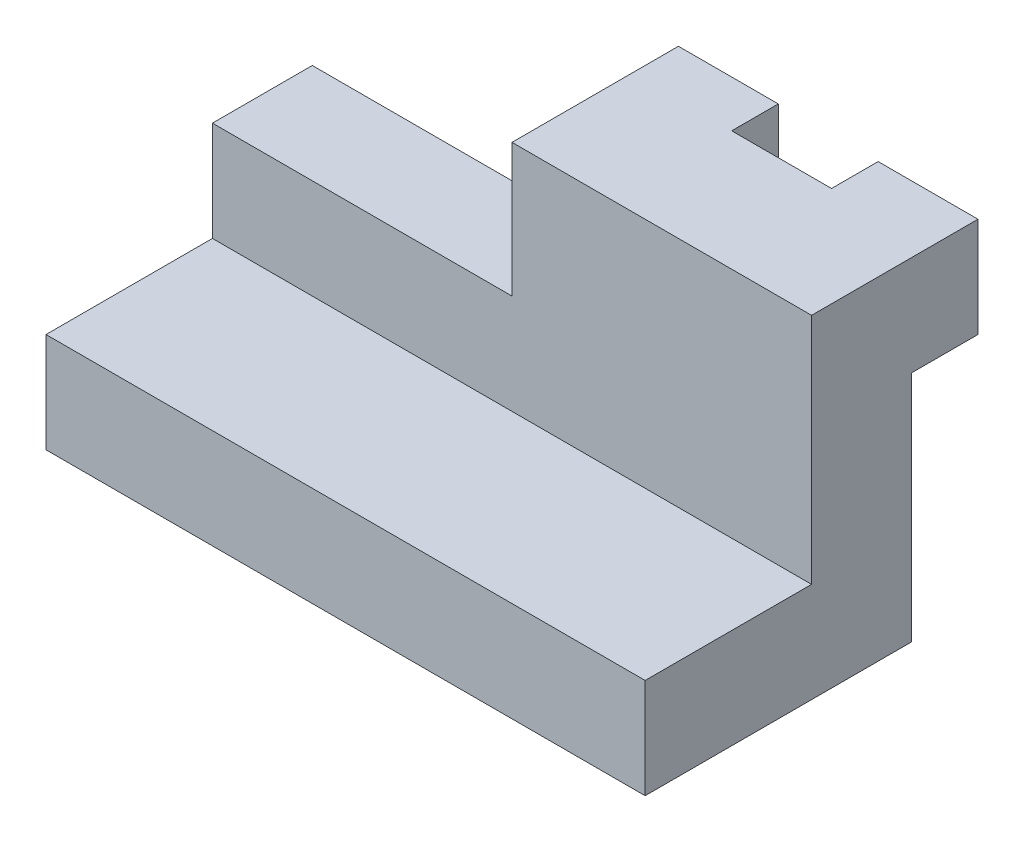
ISO-10303-21;
HEADER;
FILE_DESCRIPTION(('STEP AP214'),'2;1');
FILE_NAME('part.step','',(''),(''),'','','');
FILE_SCHEMA(('AUTOMOTIVE_DESIGN { 1 0 10303 214 1 1 1 1 }'));
ENDSEC;
DATA;
#1=APPLICATION_CONTEXT('core data for automotive mechanical design processes');
#2=APPLICATION_PROTOCOL_DEFINITION('international standard','automotive_design',2000,#1);
#3=PRODUCT_CONTEXT('',#1,'mechanical');
#4=PRODUCT('Part','Part','',(#3));
#5=PRODUCT_RELATED_PRODUCT_CATEGORY('part','',(#4));
#6=PRODUCT_DEFINITION_FORMATION('','',#4);
#7=PRODUCT_DEFINITION_CONTEXT('part definition',#1,'design');
#8=PRODUCT_DEFINITION('design','',#6,#7);
#9=PRODUCT_DEFINITION_SHAPE('','',#8);
#10=(LENGTH_UNIT() NAMED_UNIT(*) SI_UNIT(.MILLI.,.METRE.));
#11=(NAMED_UNIT(*) PLANE_ANGLE_UNIT() SI_UNIT($,.RADIAN.));
#12=(NAMED_UNIT(*) SI_UNIT($,.STERADIAN.) SOLID_ANGLE_UNIT());
#13=UNCERTAINTY_MEASURE_WITH_UNIT(LENGTH_MEASURE(1.E-05),#10,'distance_accuracy_value','');
#14=(GEOMETRIC_REPRESENTATION_CONTEXT(3) GLOBAL_UNCERTAINTY_ASSIGNED_CONTEXT((#13)) GLOBAL_UNIT_ASSIGNED_CONTEXT((#10,
#11,#12)) REPRESENTATION_CONTEXT('',''));
#15=CARTESIAN_POINT('',(0.,0.,0.));
#16=DIRECTION('',(0.,0.,1.));
#17=DIRECTION('',(1.,0.,0.));
#18=AXIS2_PLACEMENT_3D('',#15,#16,#17);
#19=CARTESIAN_POINT('',(0.,15.,-40.));
#20=DIRECTION('',(0.,-1.,0.));
#21=DIRECTION('',(0.,0.,-1.));
#22=AXIS2_PLACEMENT_3D('',#19,#20,#21);
#23=PLANE('',#22);
#24=DIRECTION('',(1.,0.,0.));
#25=VECTOR('',#24,1.);
#26=CARTESIAN_POINT('',(0.,15.,-25.));
#27=LINE('',#26,#25);
#28=CARTESIAN_POINT('',(0.,15.,-25.));
#29=VERTEX_POINT('',#28);
#30=CARTESIAN_POINT('',(90.,15.,-25.));
#31=VERTEX_POINT('',#30);
#32=EDGE_CURVE('E56',#29,#31,#27,.T.);
#33=ORIENTED_EDGE('',*,*,#32,.F.);
#34=DIRECTION('',(0.,0.,1.));
#35=VECTOR('',#34,1.);
#36=CARTESIAN_POINT('',(0.,15.,0.));
#37=LINE('',#36,#35);
#38=CARTESIAN_POINT('',(0.,15.,0.));
#39=VERTEX_POINT('',#38);
#40=EDGE_CURVE('E218',#29,#39,#37,.T.);
#41=ORIENTED_EDGE('',*,*,#40,.T.);
#42=DIRECTION('',(1.,0.,0.));
#43=VECTOR('',#42,1.);
#44=CARTESIAN_POINT('',(0.,15.,0.));
#45=LINE('',#44,#43);
#46=CARTESIAN_POINT('',(90.,15.,0.));
#47=VERTEX_POINT('',#46);
#48=EDGE_CURVE('E212',#39,#47,#45,.T.);
#49=ORIENTED_EDGE('',*,*,#48,.T.);
#50=DIRECTION('',(0.,0.,-1.));
#51=VECTOR('',#50,1.);
#52=CARTESIAN_POINT('',(90.,15.,0.));
#53=LINE('',#52,#51);
#54=EDGE_CURVE('E205',#47,#31,#53,.T.);
#55=ORIENTED_EDGE('',*,*,#54,.T.);
#56=EDGE_LOOP('',(#33,#41,#49,#55));
#57=FACE_BOUND('',#56,.T.);
#58=ADVANCED_FACE('F31',(#57),#23,.F.);
#59=CARTESIAN_POINT('',(0.,15.,0.));
#60=DIRECTION('',(1.,0.,0.));
#61=DIRECTION('',(0.,0.,-1.));
#62=AXIS2_PLACEMENT_3D('',#59,#60,#61);
#63=PLANE('',#62);
#64=DIRECTION('',(0.,0.,1.));
#65=VECTOR('',#64,1.);
#66=CARTESIAN_POINT('',(0.,0.,0.));
#67=LINE('',#66,#65);
#68=CARTESIAN_POINT('',(0.,0.,-40.));
#69=VERTEX_POINT('',#68);
#70=CARTESIAN_POINT('',(0.,0.,0.));
#71=VERTEX_POINT('',#70);
#72=EDGE_CURVE('E229',#69,#71,#67,.T.);
#73=ORIENTED_EDGE('',*,*,#72,.T.);
#74=DIRECTION('',(0.,-1.,0.));
#75=VECTOR('',#74,1.);
#76=CARTESIAN_POINT('',(0.,15.,0.));
#77=LINE('',#76,#75);
#78=EDGE_CURVE('E11',#39,#71,#77,.T.);
#79=ORIENTED_EDGE('',*,*,#78,.F.);
#80=ORIENTED_EDGE('',*,*,#40,.F.);
#81=DIRECTION('',(0.,-1.,0.));
#82=VECTOR('',#81,1.);
#83=CARTESIAN_POINT('',(0.,30.,-25.));
#84=LINE('',#83,#82);
#85=CARTESIAN_POINT('',(0.,30.,-25.));
#86=VERTEX_POINT('',#85);
#87=EDGE_CURVE('E143',#86,#29,#84,.T.);
#88=ORIENTED_EDGE('',*,*,#87,.F.);
#89=DIRECTION('',(0.,0.,1.));
#90=VECTOR('',#89,1.);
#91=CARTESIAN_POINT('',(0.,30.,-40.));
#92=LINE('',#91,#90);
#93=CARTESIAN_POINT('',(0.,30.,-40.));
#94=VERTEX_POINT('',#93);
#95=EDGE_CURVE('E452',#94,#86,#92,.T.);
#96=ORIENTED_EDGE('',*,*,#95,.F.);
#97=DIRECTION('',(0.,-1.,0.));
#98=VECTOR('',#97,1.);
#99=CARTESIAN_POINT('',(0.,15.,-40.));
#100=LINE('',#99,#98);
#101=EDGE_CURVE('E198',#94,#69,#100,.T.);
#102=ORIENTED_EDGE('',*,*,#101,.T.);
#103=EDGE_LOOP('',(#73,#79,#80,#88,#96,#102));
#104=FACE_BOUND('',#103,.T.);
#105=ADVANCED_FACE('F33',(#104),#63,.F.);
#106=CARTESIAN_POINT('',(0.,15.,0.));
#107=DIRECTION('',(0.,0.,-1.));
#108=DIRECTION('',(-1.,0.,0.));
#109=AXIS2_PLACEMENT_3D('',#106,#107,#108);
#110=PLANE('',#109);
#111=DIRECTION('',(1.,0.,0.));
#112=VECTOR('',#111,1.);
#113=CARTESIAN_POINT('',(0.,0.,0.));
#114=LINE('',#113,#112);
#115=CARTESIAN_POINT('',(90.,0.,0.));
#116=VERTEX_POINT('',#115);
#117=EDGE_CURVE('E231',#71,#116,#114,.T.);
#118=ORIENTED_EDGE('',*,*,#117,.T.);
#119=DIRECTION('',(0.,-1.,0.));
#120=VECTOR('',#119,1.);
#121=CARTESIAN_POINT('',(90.,15.,0.));
#122=LINE('',#121,#120);
#123=EDGE_CURVE('E40',#47,#116,#122,.T.);
#124=ORIENTED_EDGE('',*,*,#123,.F.);
#125=ORIENTED_EDGE('',*,*,#48,.F.);
#126=ORIENTED_EDGE('',*,*,#78,.T.);
#127=EDGE_LOOP('',(#118,#124,#125,#126));
#128=FACE_BOUND('',#127,.T.);
#129=ADVANCED_FACE('F241',(#128),#110,.F.);
#130=CARTESIAN_POINT('',(90.,15.,0.));
#131=DIRECTION('',(-1.,0.,0.));
#132=DIRECTION('',(0.,0.,1.));
#133=AXIS2_PLACEMENT_3D('',#130,#131,#132);
#134=PLANE('',#133);
#135=DIRECTION('',(0.,0.,-1.));
#136=VECTOR('',#135,1.);
#137=CARTESIAN_POINT('',(90.,0.,0.));
#138=LINE('',#137,#136);
#139=CARTESIAN_POINT('',(90.,0.,-40.));
#140=VERTEX_POINT('',#139);
#141=EDGE_CURVE('E232',#116,#140,#138,.T.);
#142=ORIENTED_EDGE('',*,*,#141,.T.);
#143=DIRECTION('',(0.,-1.,0.));
#144=VECTOR('',#143,1.);
#145=CARTESIAN_POINT('',(90.,15.,-40.));
#146=LINE('',#145,#144);
#147=CARTESIAN_POINT('',(90.,35.,-40.));
#148=VERTEX_POINT('',#147);
#149=EDGE_CURVE('E196',#148,#140,#146,.T.);
#150=ORIENTED_EDGE('',*,*,#149,.F.);
#151=DIRECTION('',(0.,0.,-1.));
#152=VECTOR('',#151,1.);
#153=CARTESIAN_POINT('',(90.,35.,-50.));
#154=LINE('',#153,#152);
#155=CARTESIAN_POINT('',(90.,35.,-50.));
#156=VERTEX_POINT('',#155);
#157=EDGE_CURVE('E181',#148,#156,#154,.T.);
#158=ORIENTED_EDGE('',*,*,#157,.T.);
#159=DIRECTION('',(0.,-1.,0.));
#160=VECTOR('',#159,1.);
#161=CARTESIAN_POINT('',(90.,50.,-50.));
#162=LINE('',#161,#160);
#163=CARTESIAN_POINT('',(90.,50.,-50.));
#164=VERTEX_POINT('',#163);
#165=EDGE_CURVE('E150',#164,#156,#162,.T.);
#166=ORIENTED_EDGE('',*,*,#165,.F.);
#167=DIRECTION('',(0.,0.,-1.));
#168=VECTOR('',#167,1.);
#169=CARTESIAN_POINT('',(90.,50.,-50.));
#170=LINE('',#169,#168);
#171=CARTESIAN_POINT('',(90.,50.,-25.));
#172=VERTEX_POINT('',#171);
#173=EDGE_CURVE('E147',#172,#164,#170,.T.);
#174=ORIENTED_EDGE('',*,*,#173,.F.);
#175=DIRECTION('',(0.,-1.,0.));
#176=VECTOR('',#175,1.);
#177=CARTESIAN_POINT('',(90.,30.,-25.));
#178=LINE('',#177,#176);
#179=EDGE_CURVE('E134',#172,#31,#178,.T.);
#180=ORIENTED_EDGE('',*,*,#179,.T.);
#181=ORIENTED_EDGE('',*,*,#54,.F.);
#182=ORIENTED_EDGE('',*,*,#123,.T.);
#183=EDGE_LOOP('',(#142,#150,#158,#166,#174,#180,#181,#182));
#184=FACE_BOUND('',#183,.T.);
#185=ADVANCED_FACE('F148',(#184),#134,.F.);
#186=CARTESIAN_POINT('',(0.,15.,-40.));
#187=DIRECTION('',(0.,0.,1.));
#188=DIRECTION('',(1.,0.,0.));
#189=AXIS2_PLACEMENT_3D('',#186,#187,#188);
#190=PLANE('',#189);
#191=DIRECTION('',(-1.,0.,0.));
#192=VECTOR('',#191,1.);
#193=CARTESIAN_POINT('',(0.,0.,-40.));
#194=LINE('',#193,#192);
#195=EDGE_CURVE('E215',#140,#69,#194,.T.);
#196=ORIENTED_EDGE('',*,*,#195,.T.);
#197=ORIENTED_EDGE('',*,*,#101,.F.);
#198=DIRECTION('',(-1.,0.,0.));
#199=VECTOR('',#198,1.);
#200=CARTESIAN_POINT('',(0.,30.,-40.));
#201=LINE('',#200,#199);
#202=CARTESIAN_POINT('',(45.,30.,-40.));
#203=VERTEX_POINT('',#202);
#204=EDGE_CURVE('E144',#203,#94,#201,.T.);
#205=ORIENTED_EDGE('',*,*,#204,.F.);
#206=DIRECTION('',(0.,-1.,0.));
#207=VECTOR('',#206,1.);
#208=CARTESIAN_POINT('',(45.,35.,-40.));
#209=LINE('',#208,#207);
#210=CARTESIAN_POINT('',(45.,35.,-40.));
#211=VERTEX_POINT('',#210);
#212=EDGE_CURVE('E193',#211,#203,#209,.T.);
#213=ORIENTED_EDGE('',*,*,#212,.F.);
#214=DIRECTION('',(-1.,0.,0.));
#215=VECTOR('',#214,1.);
#216=CARTESIAN_POINT('',(45.,35.,-40.));
#217=LINE('',#216,#215);
#218=EDGE_CURVE('E190',#148,#211,#217,.T.);
#219=ORIENTED_EDGE('',*,*,#218,.F.);
#220=ORIENTED_EDGE('',*,*,#149,.T.);
#221=EDGE_LOOP('',(#196,#197,#205,#213,#219,#220));
#222=FACE_BOUND('',#221,.T.);
#223=ADVANCED_FACE('F234',(#222),#190,.F.);
#224=CARTESIAN_POINT('',(0.,0.,-40.));
#225=DIRECTION('',(0.,-1.,0.));
#226=DIRECTION('',(0.,0.,-1.));
#227=AXIS2_PLACEMENT_3D('',#224,#225,#226);
#228=PLANE('',#227);
#229=ORIENTED_EDGE('',*,*,#72,.F.);
#230=ORIENTED_EDGE('',*,*,#195,.F.);
#231=ORIENTED_EDGE('',*,*,#141,.F.);
#232=ORIENTED_EDGE('',*,*,#117,.F.);
#233=EDGE_LOOP('',(#229,#230,#231,#232));
#234=FACE_BOUND('',#233,.T.);
#235=ADVANCED_FACE('F236',(#234),#228,.T.);
#236=CARTESIAN_POINT('',(0.,30.,-25.));
#237=DIRECTION('',(0.,0.,-1.));
#238=DIRECTION('',(-1.,0.,0.));
#239=AXIS2_PLACEMENT_3D('',#236,#237,#238);
#240=PLANE('',#239);
#241=ORIENTED_EDGE('',*,*,#32,.T.);
#242=ORIENTED_EDGE('',*,*,#179,.F.);
#243=DIRECTION('',(1.,0.,0.));
#244=VECTOR('',#243,1.);
#245=CARTESIAN_POINT('',(45.,50.,-25.));
#246=LINE('',#245,#244);
#247=CARTESIAN_POINT('',(45.,50.,-25.));
#248=VERTEX_POINT('',#247);
#249=EDGE_CURVE('E139',#248,#172,#246,.T.);
#250=ORIENTED_EDGE('',*,*,#249,.F.);
#251=DIRECTION('',(0.,-1.,0.));
#252=VECTOR('',#251,1.);
#253=CARTESIAN_POINT('',(45.,35.,-25.));
#254=LINE('',#253,#252);
#255=CARTESIAN_POINT('',(45.,30.,-25.));
#256=VERTEX_POINT('',#255);
#257=EDGE_CURVE('E449',#248,#256,#254,.T.);
#258=ORIENTED_EDGE('',*,*,#257,.T.);
#259=DIRECTION('',(1.,0.,0.));
#260=VECTOR('',#259,1.);
#261=CARTESIAN_POINT('',(0.,30.,-25.));
#262=LINE('',#261,#260);
#263=EDGE_CURVE('E457',#86,#256,#262,.T.);
#264=ORIENTED_EDGE('',*,*,#263,.F.);
#265=ORIENTED_EDGE('',*,*,#87,.T.);
#266=EDGE_LOOP('',(#241,#242,#250,#258,#264,#265));
#267=FACE_BOUND('',#266,.T.);
#268=ADVANCED_FACE('F136',(#267),#240,.F.);
#269=CARTESIAN_POINT('',(0.,30.,-25.));
#270=DIRECTION('',(0.,1.,0.));
#271=DIRECTION('',(0.,0.,1.));
#272=AXIS2_PLACEMENT_3D('',#269,#270,#271);
#273=PLANE('',#272);
#274=DIRECTION('',(0.,0.,1.));
#275=VECTOR('',#274,1.);
#276=CARTESIAN_POINT('',(45.,30.,-40.));
#277=LINE('',#276,#275);
#278=EDGE_CURVE('E48',#203,#256,#277,.T.);
#279=ORIENTED_EDGE('',*,*,#278,.F.);
#280=ORIENTED_EDGE('',*,*,#204,.T.);
#281=ORIENTED_EDGE('',*,*,#95,.T.);
#282=ORIENTED_EDGE('',*,*,#263,.T.);
#283=EDGE_LOOP('',(#279,#280,#281,#282));
#284=FACE_BOUND('',#283,.T.);
#285=ADVANCED_FACE('F280',(#284),#273,.T.);
#286=CARTESIAN_POINT('',(45.,35.,-40.));
#287=DIRECTION('',(1.,0.,0.));
#288=DIRECTION('',(0.,0.,-1.));
#289=AXIS2_PLACEMENT_3D('',#286,#287,#288);
#290=PLANE('',#289);
#291=ORIENTED_EDGE('',*,*,#278,.T.);
#292=ORIENTED_EDGE('',*,*,#257,.F.);
#293=DIRECTION('',(0.,0.,1.));
#294=VECTOR('',#293,1.);
#295=CARTESIAN_POINT('',(45.,50.,-25.));
#296=LINE('',#295,#294);
#297=CARTESIAN_POINT('',(45.,50.,-50.));
#298=VERTEX_POINT('',#297);
#299=EDGE_CURVE('E158',#298,#248,#296,.T.);
#300=ORIENTED_EDGE('',*,*,#299,.F.);
#301=DIRECTION('',(0.,-1.,0.));
#302=VECTOR('',#301,1.);
#303=CARTESIAN_POINT('',(45.,50.,-50.));
#304=LINE('',#303,#302);
#305=CARTESIAN_POINT('',(45.,35.,-50.));
#306=VERTEX_POINT('',#305);
#307=EDGE_CURVE('E175',#298,#306,#304,.T.);
#308=ORIENTED_EDGE('',*,*,#307,.T.);
#309=DIRECTION('',(0.,0.,1.));
#310=VECTOR('',#309,1.);
#311=CARTESIAN_POINT('',(45.,35.,-25.));
#312=LINE('',#311,#310);
#313=EDGE_CURVE('E159',#306,#211,#312,.T.);
#314=ORIENTED_EDGE('',*,*,#313,.T.);
#315=ORIENTED_EDGE('',*,*,#212,.T.);
#316=EDGE_LOOP('',(#291,#292,#300,#308,#314,#315));
#317=FACE_BOUND('',#316,.T.);
#318=ADVANCED_FACE('F286',(#317),#290,.F.);
#319=CARTESIAN_POINT('',(75.,50.,-50.));
#320=DIRECTION('',(0.,0.,1.));
#321=DIRECTION('',(1.,0.,0.));
#322=AXIS2_PLACEMENT_3D('',#319,#320,#321);
#323=PLANE('',#322);
#324=DIRECTION('',(-1.,0.,0.));
#325=VECTOR('',#324,1.);
#326=CARTESIAN_POINT('',(75.,35.,-50.));
#327=LINE('',#326,#325);
#328=CARTESIAN_POINT('',(75.,35.,-50.));
#329=VERTEX_POINT('',#328);
#330=EDGE_CURVE('E178',#156,#329,#327,.T.);
#331=ORIENTED_EDGE('',*,*,#330,.T.);
#332=DIRECTION('',(0.,-1.,0.));
#333=VECTOR('',#332,1.);
#334=CARTESIAN_POINT('',(75.,50.,-50.));
#335=LINE('',#334,#333);
#336=CARTESIAN_POINT('',(75.,50.,-50.));
#337=VERTEX_POINT('',#336);
#338=EDGE_CURVE('E417',#337,#329,#335,.T.);
#339=ORIENTED_EDGE('',*,*,#338,.F.);
#340=DIRECTION('',(-1.,0.,0.));
#341=VECTOR('',#340,1.);
#342=CARTESIAN_POINT('',(75.,50.,-50.));
#343=LINE('',#342,#341);
#344=EDGE_CURVE('E153',#164,#337,#343,.T.);
#345=ORIENTED_EDGE('',*,*,#344,.F.);
#346=ORIENTED_EDGE('',*,*,#165,.T.);
#347=EDGE_LOOP('',(#331,#339,#345,#346));
#348=FACE_BOUND('',#347,.T.);
#349=ADVANCED_FACE('F291',(#348),#323,.F.);
#350=CARTESIAN_POINT('',(75.,50.,-43.));
#351=DIRECTION('',(1.,0.,0.));
#352=DIRECTION('',(0.,0.,-1.));
#353=AXIS2_PLACEMENT_3D('',#350,#351,#352);
#354=PLANE('',#353);
#355=DIRECTION('',(0.,0.,1.));
#356=VECTOR('',#355,1.);
#357=CARTESIAN_POINT('',(75.,35.,-43.));
#358=LINE('',#357,#356);
#359=CARTESIAN_POINT('',(75.,35.,-43.));
#360=VERTEX_POINT('',#359);
#361=EDGE_CURVE('E437',#329,#360,#358,.T.);
#362=ORIENTED_EDGE('',*,*,#361,.T.);
#363=DIRECTION('',(0.,-1.,0.));
#364=VECTOR('',#363,1.);
#365=CARTESIAN_POINT('',(75.,50.,-43.));
#366=LINE('',#365,#364);
#367=CARTESIAN_POINT('',(75.,50.,-43.));
#368=VERTEX_POINT('',#367);
#369=EDGE_CURVE('E419',#368,#360,#366,.T.);
#370=ORIENTED_EDGE('',*,*,#369,.F.);
#371=DIRECTION('',(0.,0.,1.));
#372=VECTOR('',#371,1.);
#373=CARTESIAN_POINT('',(75.,50.,-43.));
#374=LINE('',#373,#372);
#375=EDGE_CURVE('E166',#337,#368,#374,.T.);
#376=ORIENTED_EDGE('',*,*,#375,.F.);
#377=ORIENTED_EDGE('',*,*,#338,.T.);
#378=EDGE_LOOP('',(#362,#370,#376,#377));
#379=FACE_BOUND('',#378,.T.);
#380=ADVANCED_FACE('F299',(#379),#354,.F.);
#381=CARTESIAN_POINT('',(60.,50.,-43.));
#382=DIRECTION('',(0.,0.,1.));
#383=DIRECTION('',(1.,0.,0.));
#384=AXIS2_PLACEMENT_3D('',#381,#382,#383);
#385=PLANE('',#384);
#386=DIRECTION('',(-1.,0.,0.));
#387=VECTOR('',#386,1.);
#388=CARTESIAN_POINT('',(60.,35.,-43.));
#389=LINE('',#388,#387);
#390=CARTESIAN_POINT('',(60.,35.,-43.));
#391=VERTEX_POINT('',#390);
#392=EDGE_CURVE('E436',#360,#391,#389,.T.);
#393=ORIENTED_EDGE('',*,*,#392,.T.);
#394=DIRECTION('',(0.,-1.,0.));
#395=VECTOR('',#394,1.);
#396=CARTESIAN_POINT('',(60.,50.,-43.));
#397=LINE('',#396,#395);
#398=CARTESIAN_POINT('',(60.,50.,-43.));
#399=VERTEX_POINT('',#398);
#400=EDGE_CURVE('E424',#399,#391,#397,.T.);
#401=ORIENTED_EDGE('',*,*,#400,.F.);
#402=DIRECTION('',(-1.,0.,0.));
#403=VECTOR('',#402,1.);
#404=CARTESIAN_POINT('',(60.,50.,-43.));
#405=LINE('',#404,#403);
#406=EDGE_CURVE('E168',#368,#399,#405,.T.);
#407=ORIENTED_EDGE('',*,*,#406,.F.);
#408=ORIENTED_EDGE('',*,*,#369,.T.);
#409=EDGE_LOOP('',(#393,#401,#407,#408));
#410=FACE_BOUND('',#409,.T.);
#411=ADVANCED_FACE('F307',(#410),#385,.F.);
#412=CARTESIAN_POINT('',(60.,50.,-50.));
#413=DIRECTION('',(-1.,0.,0.));
#414=DIRECTION('',(0.,0.,1.));
#415=AXIS2_PLACEMENT_3D('',#412,#413,#414);
#416=PLANE('',#415);
#417=DIRECTION('',(0.,0.,-1.));
#418=VECTOR('',#417,1.);
#419=CARTESIAN_POINT('',(60.,35.,-50.));
#420=LINE('',#419,#418);
#421=CARTESIAN_POINT('',(60.,35.,-50.));
#422=VERTEX_POINT('',#421);
#423=EDGE_CURVE('E434',#391,#422,#420,.T.);
#424=ORIENTED_EDGE('',*,*,#423,.T.);
#425=DIRECTION('',(0.,-1.,0.));
#426=VECTOR('',#425,1.);
#427=CARTESIAN_POINT('',(60.,50.,-50.));
#428=LINE('',#427,#426);
#429=CARTESIAN_POINT('',(60.,50.,-50.));
#430=VERTEX_POINT('',#429);
#431=EDGE_CURVE('E427',#430,#422,#428,.T.);
#432=ORIENTED_EDGE('',*,*,#431,.F.);
#433=DIRECTION('',(0.,0.,-1.));
#434=VECTOR('',#433,1.);
#435=CARTESIAN_POINT('',(60.,50.,-50.));
#436=LINE('',#435,#434);
#437=EDGE_CURVE('E170',#399,#430,#436,.T.);
#438=ORIENTED_EDGE('',*,*,#437,.F.);
#439=ORIENTED_EDGE('',*,*,#400,.T.);
#440=EDGE_LOOP('',(#424,#432,#438,#439));
#441=FACE_BOUND('',#440,.T.);
#442=ADVANCED_FACE('F315',(#441),#416,.F.);
#443=CARTESIAN_POINT('',(45.,50.,-50.));
#444=DIRECTION('',(0.,0.,1.));
#445=DIRECTION('',(1.,0.,0.));
#446=AXIS2_PLACEMENT_3D('',#443,#444,#445);
#447=PLANE('',#446);
#448=DIRECTION('',(-1.,0.,0.));
#449=VECTOR('',#448,1.);
#450=CARTESIAN_POINT('',(45.,35.,-50.));
#451=LINE('',#450,#449);
#452=EDGE_CURVE('E162',#422,#306,#451,.T.);
#453=ORIENTED_EDGE('',*,*,#452,.T.);
#454=ORIENTED_EDGE('',*,*,#307,.F.);
#455=DIRECTION('',(-1.,0.,0.));
#456=VECTOR('',#455,1.);
#457=CARTESIAN_POINT('',(45.,50.,-50.));
#458=LINE('',#457,#456);
#459=EDGE_CURVE('E172',#430,#298,#458,.T.);
#460=ORIENTED_EDGE('',*,*,#459,.F.);
#461=ORIENTED_EDGE('',*,*,#431,.T.);
#462=EDGE_LOOP('',(#453,#454,#460,#461));
#463=FACE_BOUND('',#462,.T.);
#464=ADVANCED_FACE('F323',(#463),#447,.F.);
#465=CARTESIAN_POINT('',(90.,50.,-25.));
#466=DIRECTION('',(0.,-1.,0.));
#467=DIRECTION('',(0.,0.,-1.));
#468=AXIS2_PLACEMENT_3D('',#465,#466,#467);
#469=PLANE('',#468);
#470=ORIENTED_EDGE('',*,*,#249,.T.);
#471=ORIENTED_EDGE('',*,*,#173,.T.);
#472=ORIENTED_EDGE('',*,*,#344,.T.);
#473=ORIENTED_EDGE('',*,*,#375,.T.);
#474=ORIENTED_EDGE('',*,*,#406,.T.);
#475=ORIENTED_EDGE('',*,*,#437,.T.);
#476=ORIENTED_EDGE('',*,*,#459,.T.);
#477=ORIENTED_EDGE('',*,*,#299,.T.);
#478=EDGE_LOOP('',(#470,#471,#472,#473,#474,#475,#476,#477));
#479=FACE_BOUND('',#478,.T.);
#480=ADVANCED_FACE('F156',(#479),#469,.F.);
#481=CARTESIAN_POINT('',(90.,35.,-25.));
#482=DIRECTION('',(0.,-1.,0.));
#483=DIRECTION('',(0.,0.,-1.));
#484=AXIS2_PLACEMENT_3D('',#481,#482,#483);
#485=PLANE('',#484);
#486=ORIENTED_EDGE('',*,*,#157,.F.);
#487=ORIENTED_EDGE('',*,*,#218,.T.);
#488=ORIENTED_EDGE('',*,*,#313,.F.);
#489=ORIENTED_EDGE('',*,*,#452,.F.);
#490=ORIENTED_EDGE('',*,*,#423,.F.);
#491=ORIENTED_EDGE('',*,*,#392,.F.);
#492=ORIENTED_EDGE('',*,*,#361,.F.);
#493=ORIENTED_EDGE('',*,*,#330,.F.);
#494=EDGE_LOOP('',(#486,#487,#488,#489,#490,#491,#492,#493));
#495=FACE_BOUND('',#494,.T.);
#496=ADVANCED_FACE('F338',(#495),#485,.T.);
#497=CLOSED_SHELL('',(#58,#105,#129,#185,#223,#235,#268,#285,#318,#349,#380,#411,#442,#464,#480,#496));
#498=MANIFOLD_SOLID_BREP('B2',#497);
#499=ADVANCED_BREP_SHAPE_REPRESENTATION('',(#18,#498),#14);
#500=SHAPE_DEFINITION_REPRESENTATION(#9,#499);
ENDSEC;
END-ISO-10303-21;
